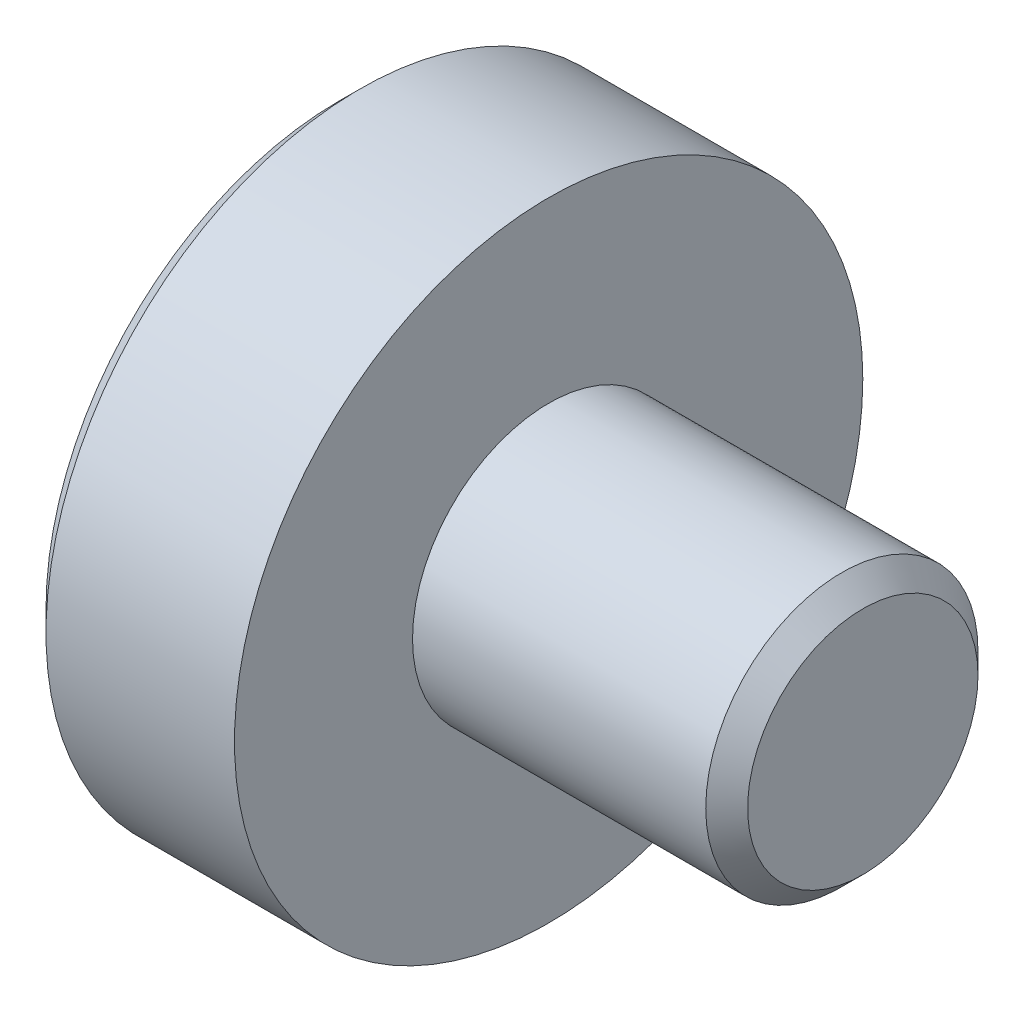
ISO-10303-21;
HEADER;
FILE_DESCRIPTION(('STEP AP214'),'2;1');
FILE_NAME('part.step','',(''),(''),'','','');
FILE_SCHEMA(('AUTOMOTIVE_DESIGN { 1 0 10303 214 1 1 1 1 }'));
ENDSEC;
DATA;
#1=APPLICATION_CONTEXT('core data for automotive mechanical design processes');
#2=APPLICATION_PROTOCOL_DEFINITION('international standard','automotive_design',2000,#1);
#3=PRODUCT_CONTEXT('',#1,'mechanical');
#4=PRODUCT('Part','Part','',(#3));
#5=PRODUCT_RELATED_PRODUCT_CATEGORY('part','',(#4));
#6=PRODUCT_DEFINITION_FORMATION('','',#4);
#7=PRODUCT_DEFINITION_CONTEXT('part definition',#1,'design');
#8=PRODUCT_DEFINITION('design','',#6,#7);
#9=PRODUCT_DEFINITION_SHAPE('','',#8);
#10=(LENGTH_UNIT() NAMED_UNIT(*) SI_UNIT(.MILLI.,.METRE.));
#11=(NAMED_UNIT(*) PLANE_ANGLE_UNIT() SI_UNIT($,.RADIAN.));
#12=(NAMED_UNIT(*) SI_UNIT($,.STERADIAN.) SOLID_ANGLE_UNIT());
#13=UNCERTAINTY_MEASURE_WITH_UNIT(LENGTH_MEASURE(1.E-05),#10,'distance_accuracy_value','');
#14=(GEOMETRIC_REPRESENTATION_CONTEXT(3) GLOBAL_UNCERTAINTY_ASSIGNED_CONTEXT((#13)) GLOBAL_UNIT_ASSIGNED_CONTEXT((#10,
#11,#12)) REPRESENTATION_CONTEXT('',''));
#15=CARTESIAN_POINT('',(0.,0.,0.));
#16=DIRECTION('',(0.,0.,1.));
#17=DIRECTION('',(1.,0.,0.));
#18=AXIS2_PLACEMENT_3D('',#15,#16,#17);
#19=CARTESIAN_POINT('',(10.,0.,0.));
#20=DIRECTION('',(-1.,0.,0.));
#21=DIRECTION('',(0.,0.,1.));
#22=AXIS2_PLACEMENT_3D('',#19,#20,#21);
#23=CYLINDRICAL_SURFACE('',#22,15.);
#24=CARTESIAN_POINT('',(1.,0.,0.));
#25=DIRECTION('',(1.,0.,0.));
#26=DIRECTION('',(0.,0.,-1.));
#27=AXIS2_PLACEMENT_3D('',#24,#25,#26);
#28=CIRCLE('',#27,15.);
#29=CARTESIAN_POINT('',(1.,0.,-15.));
#30=VERTEX_POINT('',#29);
#31=EDGE_CURVE('E37',#30,#30,#28,.T.);
#32=ORIENTED_EDGE('',*,*,#31,.T.);
#33=EDGE_LOOP('',(#32));
#34=FACE_BOUND('',#33,.T.);
#35=CARTESIAN_POINT('',(10.,0.,0.));
#36=DIRECTION('',(1.,0.,0.));
#37=DIRECTION('',(0.,0.,-1.));
#38=AXIS2_PLACEMENT_3D('',#35,#36,#37);
#39=CIRCLE('',#38,15.);
#40=CARTESIAN_POINT('',(10.,0.,-15.));
#41=VERTEX_POINT('',#40);
#42=EDGE_CURVE('E50',#41,#41,#39,.T.);
#43=ORIENTED_EDGE('',*,*,#42,.F.);
#44=EDGE_LOOP('',(#43));
#45=FACE_BOUND('',#44,.T.);
#46=ADVANCED_FACE('F30',(#34,#45),#23,.T.);
#47=CARTESIAN_POINT('',(10.,0.,0.));
#48=DIRECTION('',(1.,0.,0.));
#49=DIRECTION('',(0.,0.,-1.));
#50=AXIS2_PLACEMENT_3D('',#47,#48,#49);
#51=PLANE('',#50);
#52=CARTESIAN_POINT('',(10.,0.,0.));
#53=DIRECTION('',(1.,0.,0.));
#54=DIRECTION('',(0.,0.,-1.));
#55=AXIS2_PLACEMENT_3D('',#52,#53,#54);
#56=CIRCLE('',#55,6.5);
#57=CARTESIAN_POINT('',(10.,0.,-6.5));
#58=VERTEX_POINT('',#57);
#59=EDGE_CURVE('E53',#58,#58,#56,.T.);
#60=ORIENTED_EDGE('',*,*,#59,.F.);
#61=EDGE_LOOP('',(#60));
#62=FACE_BOUND('',#61,.T.);
#63=ORIENTED_EDGE('',*,*,#42,.T.);
#64=EDGE_LOOP('',(#63));
#65=FACE_BOUND('',#64,.T.);
#66=ADVANCED_FACE('F59',(#62,#65),#51,.T.);
#67=CARTESIAN_POINT('',(0.,0.,0.));
#68=DIRECTION('',(1.,0.,0.));
#69=DIRECTION('',(0.,0.,-1.));
#70=AXIS2_PLACEMENT_3D('',#67,#68,#69);
#71=PLANE('',#70);
#72=CARTESIAN_POINT('',(0.,0.,0.));
#73=DIRECTION('',(1.,0.,0.));
#74=DIRECTION('',(0.,0.,-1.));
#75=AXIS2_PLACEMENT_3D('',#72,#73,#74);
#76=CIRCLE('',#75,14.);
#77=CARTESIAN_POINT('',(0.,0.,-14.));
#78=VERTEX_POINT('',#77);
#79=EDGE_CURVE('E10',#78,#78,#76,.F.);
#80=ORIENTED_EDGE('',*,*,#79,.T.);
#81=EDGE_LOOP('',(#80));
#82=FACE_BOUND('',#81,.T.);
#83=ADVANCED_FACE('F62',(#82),#71,.F.);
#84=CARTESIAN_POINT('',(25.,0.,0.));
#85=DIRECTION('',(-1.,0.,0.));
#86=DIRECTION('',(0.,0.,1.));
#87=AXIS2_PLACEMENT_3D('',#84,#85,#86);
#88=CYLINDRICAL_SURFACE('',#87,6.5);
#89=CARTESIAN_POINT('',(24.,0.,0.));
#90=DIRECTION('',(1.,0.,0.));
#91=DIRECTION('',(0.,0.,-1.));
#92=AXIS2_PLACEMENT_3D('',#89,#90,#91);
#93=CIRCLE('',#92,6.5);
#94=CARTESIAN_POINT('',(24.,0.,-6.5));
#95=VERTEX_POINT('',#94);
#96=EDGE_CURVE('E41',#95,#95,#93,.F.);
#97=ORIENTED_EDGE('',*,*,#96,.T.);
#98=EDGE_LOOP('',(#97));
#99=FACE_BOUND('',#98,.T.);
#100=ORIENTED_EDGE('',*,*,#59,.T.);
#101=EDGE_LOOP('',(#100));
#102=FACE_BOUND('',#101,.T.);
#103=ADVANCED_FACE('F57',(#99,#102),#88,.T.);
#104=CARTESIAN_POINT('',(25.,0.,0.));
#105=DIRECTION('',(1.,0.,0.));
#106=DIRECTION('',(0.,0.,-1.));
#107=AXIS2_PLACEMENT_3D('',#104,#105,#106);
#108=PLANE('',#107);
#109=CARTESIAN_POINT('',(25.,0.,0.));
#110=DIRECTION('',(1.,0.,0.));
#111=DIRECTION('',(0.,0.,-1.));
#112=AXIS2_PLACEMENT_3D('',#109,#110,#111);
#113=CIRCLE('',#112,5.50000000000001);
#114=CARTESIAN_POINT('',(25.,0.,-5.50000000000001));
#115=VERTEX_POINT('',#114);
#116=EDGE_CURVE('E45',#115,#115,#113,.T.);
#117=ORIENTED_EDGE('',*,*,#116,.T.);
#118=EDGE_LOOP('',(#117));
#119=FACE_BOUND('',#118,.T.);
#120=ADVANCED_FACE('F73',(#119),#108,.T.);
#121=CARTESIAN_POINT('',(25.,0.,0.));
#122=DIRECTION('',(-1.,0.,0.));
#123=DIRECTION('',(0.,0.,1.));
#124=AXIS2_PLACEMENT_3D('',#121,#122,#123);
#125=CONICAL_SURFACE('',#124,5.50000000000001,0.785398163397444);
#126=ORIENTED_EDGE('',*,*,#96,.F.);
#127=EDGE_LOOP('',(#126));
#128=FACE_BOUND('',#127,.T.);
#129=ORIENTED_EDGE('',*,*,#116,.F.);
#130=EDGE_LOOP('',(#129));
#131=FACE_BOUND('',#130,.T.);
#132=ADVANCED_FACE('F71',(#128,#131),#125,.T.);
#133=CARTESIAN_POINT('',(1.,0.,0.));
#134=DIRECTION('',(1.,0.,0.));
#135=DIRECTION('',(0.,0.,-1.));
#136=AXIS2_PLACEMENT_3D('',#133,#134,#135);
#137=CONICAL_SURFACE('',#136,15.,0.785398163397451);
#138=ORIENTED_EDGE('',*,*,#79,.F.);
#139=EDGE_LOOP('',(#138));
#140=FACE_BOUND('',#139,.T.);
#141=ORIENTED_EDGE('',*,*,#31,.F.);
#142=EDGE_LOOP('',(#141));
#143=FACE_BOUND('',#142,.T.);
#144=ADVANCED_FACE('F32',(#140,#143),#137,.T.);
#145=CLOSED_SHELL('',(#46,#66,#83,#103,#120,#132,#144));
#146=MANIFOLD_SOLID_BREP('B2',#145);
#147=ADVANCED_BREP_SHAPE_REPRESENTATION('',(#18,#146),#14);
#148=SHAPE_DEFINITION_REPRESENTATION(#9,#147);
ENDSEC;
END-ISO-10303-21;
